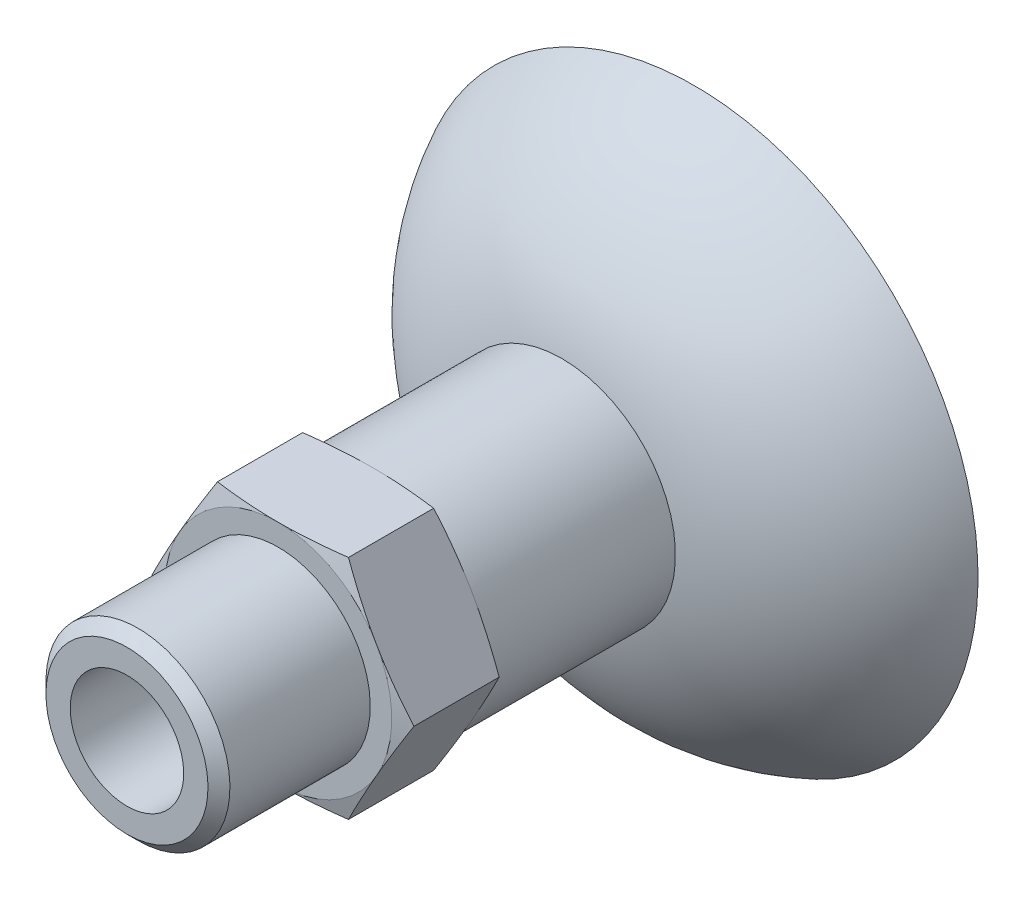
ISO-10303-21;
HEADER;
FILE_DESCRIPTION(('STEP AP214'),'2;1');
FILE_NAME('part.step','',(''),(''),'','','');
FILE_SCHEMA(('AUTOMOTIVE_DESIGN { 1 0 10303 214 1 1 1 1 }'));
ENDSEC;
DATA;
#1=APPLICATION_CONTEXT('core data for automotive mechanical design processes');
#2=APPLICATION_PROTOCOL_DEFINITION('international standard','automotive_design',2000,#1);
#3=PRODUCT_CONTEXT('',#1,'mechanical');
#4=PRODUCT('Part','Part','',(#3));
#5=PRODUCT_RELATED_PRODUCT_CATEGORY('part','',(#4));
#6=PRODUCT_DEFINITION_FORMATION('','',#4);
#7=PRODUCT_DEFINITION_CONTEXT('part definition',#1,'design');
#8=PRODUCT_DEFINITION('design','',#6,#7);
#9=PRODUCT_DEFINITION_SHAPE('','',#8);
#10=(LENGTH_UNIT() NAMED_UNIT(*) SI_UNIT(.MILLI.,.METRE.));
#11=(NAMED_UNIT(*) PLANE_ANGLE_UNIT() SI_UNIT($,.RADIAN.));
#12=(NAMED_UNIT(*) SI_UNIT($,.STERADIAN.) SOLID_ANGLE_UNIT());
#13=UNCERTAINTY_MEASURE_WITH_UNIT(LENGTH_MEASURE(1.E-05),#10,'distance_accuracy_value','');
#14=(GEOMETRIC_REPRESENTATION_CONTEXT(3) GLOBAL_UNCERTAINTY_ASSIGNED_CONTEXT((#13)) GLOBAL_UNIT_ASSIGNED_CONTEXT((#10,
#11,#12)) REPRESENTATION_CONTEXT('',''));
#15=CARTESIAN_POINT('',(0.,0.,0.));
#16=DIRECTION('',(0.,0.,1.));
#17=DIRECTION('',(1.,0.,0.));
#18=AXIS2_PLACEMENT_3D('',#15,#16,#17);
#19=CARTESIAN_POINT('',(6.92820323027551,0.,17.));
#20=DIRECTION('',(0.866025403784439,0.5,0.));
#21=DIRECTION('',(0.,0.,1.));
#22=AXIS2_PLACEMENT_3D('',#19,#20,#21);
#23=PLANE('',#22);
#24=DIRECTION('',(0.,0.,1.));
#25=VECTOR('',#24,1.);
#26=CARTESIAN_POINT('',(3.46410161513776,6.,17.));
#27=LINE('',#26,#25);
#28=CARTESIAN_POINT('',(3.46410161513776,6.,17.2487113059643));
#29=VERTEX_POINT('',#28);
#30=CARTESIAN_POINT('',(3.46410161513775,6.,21.7512886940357));
#31=VERTEX_POINT('',#30);
#32=EDGE_CURVE('E10',#29,#31,#27,.T.);
#33=ORIENTED_EDGE('',*,*,#32,.T.);
#34=CARTESIAN_POINT('',(5.19615242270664,3.00000000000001,22.));
#35=CARTESIAN_POINT('',(5.12404359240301,3.12480967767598,22.0000199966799));
#36=CARTESIAN_POINT('',(5.05188034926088,3.24958799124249,21.9986484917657));
#37=CARTESIAN_POINT('',(4.9079827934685,3.49847134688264,21.9931540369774));
#38=CARTESIAN_POINT('',(4.83624819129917,3.62257653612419,21.9890453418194));
#39=CARTESIAN_POINT('',(4.69263452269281,3.87142043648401,21.9780801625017));
#40=CARTESIAN_POINT('',(4.62075656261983,3.99615917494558,21.9712098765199));
#41=CARTESIAN_POINT('',(4.47601669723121,4.24735284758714,21.9547641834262));
#42=CARTESIAN_POINT('',(4.40315594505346,4.37380590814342,21.9451503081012));
#43=CARTESIAN_POINT('',(4.2592900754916,4.62306506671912,21.9237525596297));
#44=CARTESIAN_POINT('',(4.18828746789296,4.74587821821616,21.912033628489));
#45=CARTESIAN_POINT('',(4.04576334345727,4.99249350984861,21.8862377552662));
#46=CARTESIAN_POINT('',(3.97424314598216,5.11629421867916,21.8721398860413));
#47=CARTESIAN_POINT('',(3.83027325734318,5.36560571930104,21.8416075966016));
#48=CARTESIAN_POINT('',(3.75782595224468,5.49111391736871,21.8251409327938));
#49=CARTESIAN_POINT('',(3.61160134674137,5.74445673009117,21.7898805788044));
#50=CARTESIAN_POINT('',(3.53782665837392,5.87228726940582,21.7710466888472));
#51=CARTESIAN_POINT('',(3.46410161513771,5.99999999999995,21.7512886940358));
#52=B_SPLINE_CURVE_WITH_KNOTS('',3,(#34,#35,#36,#37,#38,#39,#40,#41,#42,#43,#44,#45,#46,#47,#48,
#49,#50,#51),.UNSPECIFIED.,.F.,.F.,(4,2,2,2,2,2,2,2,4),(0.,0.432421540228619,0.862608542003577,
1.29497279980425,1.73372521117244,2.16073850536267,2.59172526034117,3.02925966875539,
3.47560935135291),.UNSPECIFIED.);
#53=CARTESIAN_POINT('',(5.19615242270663,3.,22.));
#54=VERTEX_POINT('',#53);
#55=EDGE_CURVE('E683',#54,#31,#52,.T.);
#56=ORIENTED_EDGE('',*,*,#55,.F.);
#57=CARTESIAN_POINT('',(6.92820323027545,0.,21.7512886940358));
#58=CARTESIAN_POINT('',(6.85446990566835,0.127692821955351,21.7710449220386));
#59=CARTESIAN_POINT('',(6.78066033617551,0.255488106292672,21.7898769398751));
#60=CARTESIAN_POINT('',(6.634382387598,0.508780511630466,21.8251348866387));
#61=CARTESIAN_POINT('',(6.56191621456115,0.634273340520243,21.8416008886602));
#62=CARTESIAN_POINT('',(6.41799291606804,0.883612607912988,21.872133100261));
#63=CARTESIAN_POINT('',(6.34653685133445,1.00745570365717,21.8862314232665));
#64=CARTESIAN_POINT('',(6.20421306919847,1.2542062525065,21.9120298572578));
#65=CARTESIAN_POINT('',(6.13334596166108,1.37711187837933,21.9237507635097));
#66=CARTESIAN_POINT('',(5.98940836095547,1.62632912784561,21.9451502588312));
#67=CARTESIAN_POINT('',(5.916330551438,1.75264209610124,21.9547643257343));
#68=CARTESIAN_POINT('',(5.77116669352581,2.00357128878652,21.9712102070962));
#69=CARTESIAN_POINT('',(5.69908163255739,2.1281855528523,21.9780803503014));
#70=CARTESIAN_POINT('',(5.55538561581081,2.37698191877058,21.9890454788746));
#71=CARTESIAN_POINT('',(5.48377408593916,2.50116308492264,21.9931541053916));
#72=CARTESIAN_POINT('',(5.34017760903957,2.7502399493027,21.9986485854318));
#73=CARTESIAN_POINT('',(5.26819267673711,2.87513597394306,22.0000200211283));
#74=CARTESIAN_POINT('',(5.19615242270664,3.00000000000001,22.));
#75=B_SPLINE_CURVE_WITH_KNOTS('',3,(#57,#58,#59,#60,#61,#62,#63,#64,#65,#66,#67,#68,#69,#70,#71,
#72,#73,#74),.UNSPECIFIED.,.F.,.F.,(4,2,2,2,2,2,2,2,4),(0.,0.446310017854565,0.883832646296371,
1.3148334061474,1.7418840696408,2.18059822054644,2.61294971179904,3.04314949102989,
3.47560937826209),.UNSPECIFIED.);
#76=CARTESIAN_POINT('',(6.92820323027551,0.,21.7512886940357));
#77=VERTEX_POINT('',#76);
#78=EDGE_CURVE('E757',#77,#54,#75,.T.);
#79=ORIENTED_EDGE('',*,*,#78,.F.);
#80=DIRECTION('',(0.,0.,1.));
#81=VECTOR('',#80,1.);
#82=CARTESIAN_POINT('',(6.92820323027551,0.,17.));
#83=LINE('',#82,#81);
#84=CARTESIAN_POINT('',(6.92820323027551,0.,17.2487113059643));
#85=VERTEX_POINT('',#84);
#86=EDGE_CURVE('E497',#85,#77,#83,.T.);
#87=ORIENTED_EDGE('',*,*,#86,.F.);
#88=CARTESIAN_POINT('',(5.19615242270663,3.,17.));
#89=CARTESIAN_POINT('',(5.26818635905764,2.87514708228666,16.9999800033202));
#90=CARTESIAN_POINT('',(5.34016592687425,2.75026272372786,17.0013515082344));
#91=CARTESIAN_POINT('',(5.48375645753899,2.50120210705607,17.0068459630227));
#92=CARTESIAN_POINT('',(5.55536740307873,2.37702552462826,17.0109546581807));
#93=CARTESIAN_POINT('',(5.69906570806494,2.12823048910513,17.0219198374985));
#94=CARTESIAN_POINT('',(5.77115364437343,2.00361298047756,17.0287901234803));
#95=CARTESIAN_POINT('',(5.91632381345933,1.75266774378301,17.0452358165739));
#96=CARTESIAN_POINT('',(5.98940500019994,1.6263419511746,17.0548496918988));
#97=CARTESIAN_POINT('',(6.13333682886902,1.377120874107,17.0762474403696));
#98=CARTESIAN_POINT('',(6.20419483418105,1.25422423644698,17.0879663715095));
#99=CARTESIAN_POINT('',(6.34650787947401,1.00748707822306,17.1137622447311));
#100=CARTESIAN_POINT('',(6.41796233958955,0.883648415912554,17.1278601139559));
#101=CARTESIAN_POINT('',(6.56188748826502,0.634311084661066,17.1583924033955));
#102=CARTESIAN_POINT('',(6.63435712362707,0.50881577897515,17.1748590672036));
#103=CARTESIAN_POINT('',(6.78064613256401,0.25551014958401,17.210119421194));
#104=CARTESIAN_POINT('',(6.8544632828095,0.127704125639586,17.2289533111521));
#105=CARTESIAN_POINT('',(6.92820323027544,0.,17.2487113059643));
#106=B_SPLINE_CURVE_WITH_KNOTS('',3,(#88,#89,#90,#91,#92,#93,#94,#95,#96,#97,#98,#99,#100,#101,
#102,#103,#104,#105),.UNSPECIFIED.,.F.,.F.,(4,2,2,2,2,2,2,2,4),(0.,0.432421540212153,
0.862608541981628,1.29497279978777,1.73372521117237,2.16073850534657,2.59172526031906,
3.02925966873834,3.4756093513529),.UNSPECIFIED.);
#107=CARTESIAN_POINT('',(5.19615242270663,3.,17.));
#108=VERTEX_POINT('',#107);
#109=EDGE_CURVE('E491',#108,#85,#106,.T.);
#110=ORIENTED_EDGE('',*,*,#109,.F.);
#111=CARTESIAN_POINT('',(3.46410161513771,5.99999999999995,17.2487113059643));
#112=CARTESIAN_POINT('',(3.53782018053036,5.87229865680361,17.2289550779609));
#113=CARTESIAN_POINT('',(3.61158935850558,5.74448005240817,17.2101230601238));
#114=CARTESIAN_POINT('',(3.7578080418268,5.49115343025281,17.1748651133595));
#115=CARTESIAN_POINT('',(3.83025493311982,5.3656494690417,17.1583991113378));
#116=CARTESIAN_POINT('',(3.9742274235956,5.11633860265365,17.127866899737));
#117=CARTESIAN_POINT('',(4.04575065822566,4.99253428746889,17.1137685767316));
#118=CARTESIAN_POINT('',(4.18828101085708,4.74590300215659,17.0879701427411));
#119=CARTESIAN_POINT('',(4.25928685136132,4.62307747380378,17.0762492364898));
#120=CARTESIAN_POINT('',(4.40314652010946,4.37381523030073,17.0548497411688));
#121=CARTESIAN_POINT('',(4.47599785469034,4.24737150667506,17.0452356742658));
#122=CARTESIAN_POINT('',(4.62072698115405,3.99619132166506,17.028789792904));
#123=CARTESIAN_POINT('',(4.69260356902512,3.87145669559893,17.0219196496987));
#124=CARTESIAN_POINT('',(4.83621953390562,3.62261411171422,17.0109545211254));
#125=CARTESIAN_POINT('',(4.90795781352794,3.49850612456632,17.0068458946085));
#126=CARTESIAN_POINT('',(5.05186646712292,3.24960949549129,17.0013514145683));
#127=CARTESIAN_POINT('',(5.12403713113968,3.12482070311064,16.9999799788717));
#128=CARTESIAN_POINT('',(5.19615242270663,3.,17.));
#129=B_SPLINE_CURVE_WITH_KNOTS('',3,(#111,#112,#113,#114,#115,#116,#117,#118,#119,#120,#121,
#122,#123,#124,#125,#126,#127,#128),.UNSPECIFIED.,.F.,.F.,(4,2,2,2,2,2,2,2,4),(0.,
0.446310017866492,0.883832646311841,1.31483340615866,1.74188406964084,2.18059822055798,
2.61294971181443,3.04314949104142,3.47560937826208),.UNSPECIFIED.);
#130=EDGE_CURVE('E473',#29,#108,#129,.T.);
#131=ORIENTED_EDGE('',*,*,#130,.F.);
#132=EDGE_LOOP('',(#33,#56,#79,#87,#110,#131));
#133=FACE_BOUND('',#132,.T.);
#134=ADVANCED_FACE('F15',(#133),#23,.T.);
#135=CARTESIAN_POINT('',(3.46410161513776,6.,17.));
#136=DIRECTION('',(0.,1.,0.));
#137=DIRECTION('',(-1.,0.,0.));
#138=AXIS2_PLACEMENT_3D('',#135,#136,#137);
#139=PLANE('',#138);
#140=DIRECTION('',(0.,0.,1.));
#141=VECTOR('',#140,1.);
#142=CARTESIAN_POINT('',(-3.46410161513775,6.,17.));
#143=LINE('',#142,#141);
#144=CARTESIAN_POINT('',(-3.46410161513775,6.,17.2487113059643));
#145=VERTEX_POINT('',#144);
#146=CARTESIAN_POINT('',(-3.46410161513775,6.,21.7512886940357));
#147=VERTEX_POINT('',#146);
#148=EDGE_CURVE('E29',#145,#147,#143,.T.);
#149=ORIENTED_EDGE('',*,*,#148,.T.);
#150=CARTESIAN_POINT('',(0.,6.00000000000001,22.));
#151=CARTESIAN_POINT('',(-0.144124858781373,5.99995669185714,22.0000200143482));
#152=CARTESIAN_POINT('',(-0.288249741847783,5.99985529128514,21.998647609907));
#153=CARTESIAN_POINT('',(-0.575724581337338,5.9996917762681,21.9931504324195));
#154=CARTESIAN_POINT('',(-0.719074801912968,5.99962946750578,21.9890394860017));
#155=CARTESIAN_POINT('',(-1.00641973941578,5.99969625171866,21.9780688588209));
#156=CARTESIAN_POINT('',(-1.15041390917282,5.99982634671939,21.9711949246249));
#157=CARTESIAN_POINT('',(-1.44040510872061,6.00008659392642,21.9547411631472));
#158=CARTESIAN_POINT('',(-1.58639991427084,6.00021671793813,21.9451224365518));
#159=CARTESIAN_POINT('',(-1.87425873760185,6.00025188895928,21.9237187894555));
#160=CARTESIAN_POINT('',(-2.0161276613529,6.00016292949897,21.9119995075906));
#161=CARTESIAN_POINT('',(-2.30096544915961,6.00002759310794,21.8862047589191));
#162=CARTESIAN_POINT('',(-2.44393243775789,5.99998161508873,21.872108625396));
#163=CARTESIAN_POINT('',(-2.73179478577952,5.99993999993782,21.8415817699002));
#164=CARTESIAN_POINT('',(-2.87668673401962,5.99994513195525,21.8251190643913));
#165=CARTESIAN_POINT('',(-3.16913182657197,5.99997062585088,21.7898686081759));
#166=CARTESIAN_POINT('',(-3.3166801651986,5.9999912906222,21.771040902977));
#167=CARTESIAN_POINT('',(-3.46410161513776,6.00000000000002,21.7512886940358));
#168=B_SPLINE_CURVE_WITH_KNOTS('',3,(#150,#151,#152,#153,#154,#155,#156,#157,#158,#159,#160,
#161,#162,#163,#164,#165,#166,#167),.UNSPECIFIED.,.F.,.F.,(4,2,2,2,2,2,2,2,4),(0.,
0.432367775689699,0.86256894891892,1.2950184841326,1.73393012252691,2.16096837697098,
2.59193173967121,3.02939030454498,3.47560819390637),.UNSPECIFIED.);
#169=CARTESIAN_POINT('',(0.,6.,22.));
#170=VERTEX_POINT('',#169);
#171=EDGE_CURVE('E690',#170,#147,#168,.T.);
#172=ORIENTED_EDGE('',*,*,#171,.F.);
#173=CARTESIAN_POINT('',(3.46410161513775,6.00000000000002,21.7512886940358));
#174=CARTESIAN_POINT('',(3.31726869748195,5.99999159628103,21.7709619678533));
#175=CARTESIAN_POINT('',(3.17031004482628,5.99996749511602,21.7897190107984));
#176=CARTESIAN_POINT('',(2.87903739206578,5.99993021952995,21.8248474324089));
#177=CARTESIAN_POINT('',(2.73472816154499,5.9999168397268,21.8412584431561));
#178=CARTESIAN_POINT('',(2.4480336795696,5.99993958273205,21.8717010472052));
#179=CARTESIAN_POINT('',(2.30565182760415,5.99997497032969,21.8857644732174));
#180=CARTESIAN_POINT('',(2.02199764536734,6.00008886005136,21.9115131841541));
#181=CARTESIAN_POINT('',(1.88072720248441,6.00016696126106,21.9232192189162));
#182=CARTESIAN_POINT('',(1.59291852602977,6.00012156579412,21.9447025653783));
#183=CARTESIAN_POINT('',(1.44637393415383,5.99999070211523,21.9543951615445));
#184=CARTESIAN_POINT('',(1.15526705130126,5.99974077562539,21.9709752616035));
#185=CARTESIAN_POINT('',(1.01070698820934,5.99962156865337,21.9779015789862));
#186=CARTESIAN_POINT('',(0.72219940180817,5.99958067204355,21.9889562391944));
#187=CARTESIAN_POINT('',(0.578252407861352,5.99965800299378,21.9930983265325));
#188=CARTESIAN_POINT('',(0.289537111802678,5.99984558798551,21.9986377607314));
#189=CARTESIAN_POINT('',(0.14476852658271,5.9999560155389,22.0000203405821));
#190=CARTESIAN_POINT('',(0.,6.00000000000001,22.));
#191=B_SPLINE_CURVE_WITH_KNOTS('',3,(#173,#174,#175,#176,#177,#178,#179,#180,#181,#182,#183,
#184,#185,#186,#187,#188,#189,#190),.UNSPECIFIED.,.F.,.F.,(4,2,2,2,2,2,2,2,4),(0.,
0.444436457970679,0.880140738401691,1.30934776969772,1.73459368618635,2.17516540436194,
2.60931783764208,3.04131099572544,3.47560975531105),.UNSPECIFIED.);
#192=EDGE_CURVE('E679',#31,#170,#191,.T.);
#193=ORIENTED_EDGE('',*,*,#192,.F.);
#194=ORIENTED_EDGE('',*,*,#32,.F.);
#195=CARTESIAN_POINT('',(0.,6.,17.));
#196=CARTESIAN_POINT('',(0.144124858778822,5.99995669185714,16.9999799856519));
#197=CARTESIAN_POINT('',(0.288249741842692,5.99985529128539,17.001352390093));
#198=CARTESIAN_POINT('',(0.575724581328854,5.99969177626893,17.0068495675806));
#199=CARTESIAN_POINT('',(0.719074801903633,5.99962946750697,17.0109605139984));
#200=CARTESIAN_POINT('',(1.00641973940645,5.99969625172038,17.0219311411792));
#201=CARTESIAN_POINT('',(1.15041390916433,5.99982634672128,17.0288050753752));
#202=CARTESIAN_POINT('',(1.44040510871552,6.0000865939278,17.0452588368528));
#203=CARTESIAN_POINT('',(1.58639991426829,6.00021671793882,17.0548775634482));
#204=CARTESIAN_POINT('',(1.87425873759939,6.00025188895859,17.0762812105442));
#205=CARTESIAN_POINT('',(2.01612766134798,6.0001629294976,17.0880004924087));
#206=CARTESIAN_POINT('',(2.30096544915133,6.00002759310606,17.1137952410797));
#207=CARTESIAN_POINT('',(2.44393243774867,5.99998161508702,17.1278913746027));
#208=CARTESIAN_POINT('',(2.73179478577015,5.99993999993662,17.1584182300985));
#209=CARTESIAN_POINT('',(2.87668673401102,5.9999451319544,17.1748809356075));
#210=CARTESIAN_POINT('',(3.16913182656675,5.99997062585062,17.2101313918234));
#211=CARTESIAN_POINT('',(3.31668016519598,5.99999129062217,17.2289590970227));
#212=CARTESIAN_POINT('',(3.46410161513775,6.00000000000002,17.2487113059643));
#213=B_SPLINE_CURVE_WITH_KNOTS('',3,(#195,#196,#197,#198,#199,#200,#201,#202,#203,#204,#205,
#206,#207,#208,#209,#210,#211,#212),.UNSPECIFIED.,.F.,.F.,(4,2,2,2,2,2,2,2,4),(0.,
0.432367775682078,0.862568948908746,1.29501848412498,1.7339301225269,2.16096837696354,
2.59193173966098,3.02939030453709,3.47560819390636),.UNSPECIFIED.);
#214=CARTESIAN_POINT('',(0.,6.,17.));
#215=VERTEX_POINT('',#214);
#216=EDGE_CURVE('E436',#215,#29,#213,.T.);
#217=ORIENTED_EDGE('',*,*,#216,.F.);
#218=CARTESIAN_POINT('',(-3.46410161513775,6.00000000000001,17.2487113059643));
#219=CARTESIAN_POINT('',(-3.31726869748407,5.99999159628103,17.229038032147));
#220=CARTESIAN_POINT('',(-3.17031004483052,5.99996749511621,17.2102809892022));
#221=CARTESIAN_POINT('',(-2.87903739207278,5.99993021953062,17.1751525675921));
#222=CARTESIAN_POINT('',(-2.73472816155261,5.99991683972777,17.158741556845));
#223=CARTESIAN_POINT('',(-2.44803367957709,5.99993958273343,17.1282989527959));
#224=CARTESIAN_POINT('',(-2.30565182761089,5.99997497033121,17.1142355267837));
#225=CARTESIAN_POINT('',(-2.02199764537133,6.00008886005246,17.0884868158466));
#226=CARTESIAN_POINT('',(-1.8807272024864,6.00016696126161,17.0767807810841));
#227=CARTESIAN_POINT('',(-1.59291852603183,6.00012156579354,17.0552974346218));
#228=CARTESIAN_POINT('',(-1.44637393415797,5.99999070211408,17.0456048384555));
#229=CARTESIAN_POINT('',(-1.15526705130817,5.99974077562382,17.0290247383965));
#230=CARTESIAN_POINT('',(-1.01070698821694,5.99962156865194,17.0220984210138));
#231=CARTESIAN_POINT('',(-0.722199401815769,5.99958067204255,17.0110437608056));
#232=CARTESIAN_POINT('',(-0.578252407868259,5.99965800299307,17.0069016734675));
#233=CARTESIAN_POINT('',(-0.289537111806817,5.99984558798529,17.0013622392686));
#234=CARTESIAN_POINT('',(-0.144768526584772,5.99995601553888,16.9999796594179));
#235=CARTESIAN_POINT('',(0.,6.,17.));
#236=B_SPLINE_CURVE_WITH_KNOTS('',3,(#218,#219,#220,#221,#222,#223,#224,#225,#226,#227,#228,
#229,#230,#231,#232,#233,#234,#235),.UNSPECIFIED.,.F.,.F.,(4,2,2,2,2,2,2,2,4),(0.,
0.444436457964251,0.880140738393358,1.30934776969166,1.73459368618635,2.17516540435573,
2.6093178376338,3.04131099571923,3.47560975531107),.UNSPECIFIED.);
#237=EDGE_CURVE('E437',#145,#215,#236,.T.);
#238=ORIENTED_EDGE('',*,*,#237,.F.);
#239=EDGE_LOOP('',(#149,#172,#193,#194,#217,#238));
#240=FACE_BOUND('',#239,.T.);
#241=ADVANCED_FACE('F213',(#240),#139,.T.);
#242=CARTESIAN_POINT('',(-3.46410161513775,6.,17.));
#243=DIRECTION('',(-0.866025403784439,0.5,0.));
#244=DIRECTION('',(0.,0.,-1.));
#245=AXIS2_PLACEMENT_3D('',#242,#243,#244);
#246=PLANE('',#245);
#247=DIRECTION('',(0.,0.,1.));
#248=VECTOR('',#247,1.);
#249=CARTESIAN_POINT('',(-6.92820323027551,0.,17.));
#250=LINE('',#249,#248);
#251=CARTESIAN_POINT('',(-6.92820323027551,0.,17.2487113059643));
#252=VERTEX_POINT('',#251);
#253=CARTESIAN_POINT('',(-6.92820323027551,0.,21.7512886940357));
#254=VERTEX_POINT('',#253);
#255=EDGE_CURVE('E107',#252,#254,#250,.T.);
#256=ORIENTED_EDGE('',*,*,#255,.T.);
#257=CARTESIAN_POINT('',(-5.19615242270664,3.,22.));
#258=CARTESIAN_POINT('',(-5.26818635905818,2.87514708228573,22.0000199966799));
#259=CARTESIAN_POINT('',(-5.34016592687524,2.75026272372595,21.9986484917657));
#260=CARTESIAN_POINT('',(-5.48375645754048,2.5012021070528,21.9931540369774));
#261=CARTESIAN_POINT('',(-5.55536740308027,2.3770255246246,21.9890453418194));
#262=CARTESIAN_POINT('',(-5.69906570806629,2.12823048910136,21.9780801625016));
#263=CARTESIAN_POINT('',(-5.77115364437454,2.00361298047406,21.9712098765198));
#264=CARTESIAN_POINT('',(-5.91632381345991,1.75266774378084,21.9547641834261));
#265=CARTESIAN_POINT('',(-5.98940500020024,1.6263419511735,21.9451503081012));
#266=CARTESIAN_POINT('',(-6.1333368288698,1.37712087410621,21.9237525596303));
#267=CARTESIAN_POINT('',(-6.20419483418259,1.25422423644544,21.9120336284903));
#268=CARTESIAN_POINT('',(-6.34650787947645,1.00748707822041,21.8862377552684));
#269=CARTESIAN_POINT('',(-6.41796233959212,0.883648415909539,21.8721398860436));
#270=CARTESIAN_POINT('',(-6.56188748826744,0.634311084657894,21.841607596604));
#271=CARTESIAN_POINT('',(-6.6343571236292,0.508815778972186,21.8251409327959));
#272=CARTESIAN_POINT('',(-6.78064613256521,0.255510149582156,21.7898805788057));
#273=CARTESIAN_POINT('',(-6.85446328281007,0.127704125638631,21.7710466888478));
#274=CARTESIAN_POINT('',(-6.92820323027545,0.,21.7512886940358));
#275=B_SPLINE_CURVE_WITH_KNOTS('',3,(#257,#258,#259,#260,#261,#262,#263,#264,#265,#266,#267,
#268,#269,#270,#271,#272,#273,#274),.UNSPECIFIED.,.F.,.F.,(4,2,2,2,2,2,2,2,4),(0.,
0.432421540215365,0.862608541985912,1.29497279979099,1.73372521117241,2.16073850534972,
2.59172526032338,3.02925966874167,3.4756093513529),.UNSPECIFIED.);
#276=CARTESIAN_POINT('',(-5.19615242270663,3.,22.));
#277=VERTEX_POINT('',#276);
#278=EDGE_CURVE('E861',#277,#254,#275,.T.);
#279=ORIENTED_EDGE('',*,*,#278,.F.);
#280=CARTESIAN_POINT('',(-3.46410161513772,5.99999999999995,21.7512886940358));
#281=CARTESIAN_POINT('',(-3.53782018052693,5.87229865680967,21.7710449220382));
#282=CARTESIAN_POINT('',(-3.61158935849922,5.74448005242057,21.7898769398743));
#283=CARTESIAN_POINT('',(-3.75780804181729,5.49115343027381,21.8251348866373));
#284=CARTESIAN_POINT('',(-3.83025493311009,5.36564946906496,21.8416008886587));
#285=CARTESIAN_POINT('',(-3.97422742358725,5.11633860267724,21.8721331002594));
#286=CARTESIAN_POINT('',(-4.04575065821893,4.99253428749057,21.8862314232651));
#287=CARTESIAN_POINT('',(-4.18828101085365,4.74590300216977,21.912029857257));
#288=CARTESIAN_POINT('',(-4.2592868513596,4.62307747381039,21.9237507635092));
#289=CARTESIAN_POINT('',(-4.40314652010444,4.3738152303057,21.9451502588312));
#290=CARTESIAN_POINT('',(-4.47599785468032,4.247371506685,21.9547643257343));
#291=CARTESIAN_POINT('',(-4.62072698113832,3.99619132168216,21.9712102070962));
#292=CARTESIAN_POINT('',(-4.69260356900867,3.87145669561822,21.9780803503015));
#293=CARTESIAN_POINT('',(-4.83621953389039,3.62261411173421,21.9890454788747));
#294=CARTESIAN_POINT('',(-4.90795781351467,3.49850612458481,21.9931541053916));
#295=CARTESIAN_POINT('',(-5.05186646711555,3.24960949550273,21.9986485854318));
#296=CARTESIAN_POINT('',(-5.12403713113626,3.1248207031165,22.0000200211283));
#297=CARTESIAN_POINT('',(-5.19615242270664,3.,22.));
#298=B_SPLINE_CURVE_WITH_KNOTS('',3,(#280,#281,#282,#283,#284,#285,#286,#287,#288,#289,#290,
#291,#292,#293,#294,#295,#296,#297),.UNSPECIFIED.,.F.,.F.,(4,2,2,2,2,2,2,2,4),(0.,
0.446310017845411,0.883832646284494,1.31483340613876,1.74188406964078,2.18059822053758,
2.61294971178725,3.04314949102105,3.47560937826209),.UNSPECIFIED.);
#299=EDGE_CURVE('E692',#147,#277,#298,.T.);
#300=ORIENTED_EDGE('',*,*,#299,.F.);
#301=ORIENTED_EDGE('',*,*,#148,.F.);
#302=CARTESIAN_POINT('',(-5.19615242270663,3.,17.));
#303=CARTESIAN_POINT('',(-5.12404359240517,3.12480967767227,16.9999800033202));
#304=CARTESIAN_POINT('',(-5.05188034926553,3.24958799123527,17.0013515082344));
#305=CARTESIAN_POINT('',(-4.90798279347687,3.49847134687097,17.0068459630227));
#306=CARTESIAN_POINT('',(-4.83624819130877,3.62257653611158,17.0109546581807));
#307=CARTESIAN_POINT('',(-4.69263452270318,3.87142043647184,17.0219198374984));
#308=CARTESIAN_POINT('',(-4.62075656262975,3.99615917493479,17.0287901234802));
#309=CARTESIAN_POINT('',(-4.47601669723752,4.24735284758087,17.0452358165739));
#310=CARTESIAN_POINT('',(-4.40315594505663,4.37380590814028,17.0548496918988));
#311=CARTESIAN_POINT('',(-4.25929007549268,4.62306506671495,17.0762474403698));
#312=CARTESIAN_POINT('',(-4.18828746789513,4.74587821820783,17.0879663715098));
#313=CARTESIAN_POINT('',(-4.04576334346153,4.99249350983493,17.1137622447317));
#314=CARTESIAN_POINT('',(-3.97424314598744,5.11629421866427,17.1278601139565));
#315=CARTESIAN_POINT('',(-3.83027325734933,5.36560571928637,17.1583924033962));
#316=CARTESIAN_POINT('',(-3.7578259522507,5.49111391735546,17.1748590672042));
#317=CARTESIAN_POINT('',(-3.6116013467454,5.74445673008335,17.2101194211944));
#318=CARTESIAN_POINT('',(-3.53782665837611,5.872287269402,17.2289533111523));
#319=CARTESIAN_POINT('',(-3.46410161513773,5.99999999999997,17.2487113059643));
#320=B_SPLINE_CURVE_WITH_KNOTS('',3,(#302,#303,#304,#305,#306,#307,#308,#309,#310,#311,#312,
#313,#314,#315,#316,#317,#318,#319),.UNSPECIFIED.,.F.,.F.,(4,2,2,2,2,2,2,2,4),(0.,
0.432421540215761,0.862608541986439,1.29497279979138,1.7337252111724,2.16073850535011,
2.59172526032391,3.02925966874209,3.47560935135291),.UNSPECIFIED.);
#321=CARTESIAN_POINT('',(-5.19615242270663,3.,17.));
#322=VERTEX_POINT('',#321);
#323=EDGE_CURVE('E593',#322,#145,#320,.T.);
#324=ORIENTED_EDGE('',*,*,#323,.F.);
#325=CARTESIAN_POINT('',(-6.92820323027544,0.,17.2487113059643));
#326=CARTESIAN_POINT('',(-6.85446990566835,0.127692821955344,17.2289550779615));
#327=CARTESIAN_POINT('',(-6.78066033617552,0.255488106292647,17.2101230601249));
#328=CARTESIAN_POINT('',(-6.63438238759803,0.508780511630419,17.1748651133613));
#329=CARTESIAN_POINT('',(-6.56191621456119,0.63427334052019,17.1583991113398));
#330=CARTESIAN_POINT('',(-6.41799291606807,0.883612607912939,17.127866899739));
#331=CARTESIAN_POINT('',(-6.34653685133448,1.00745570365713,17.1137685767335));
#332=CARTESIAN_POINT('',(-6.20421306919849,1.25420625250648,17.0879701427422));
#333=CARTESIAN_POINT('',(-6.13334596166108,1.37711187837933,17.0762492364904));
#334=CARTESIAN_POINT('',(-5.98940836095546,1.6263291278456,17.0548497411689));
#335=CARTESIAN_POINT('',(-5.916330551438,1.7526420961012,17.0452356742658));
#336=CARTESIAN_POINT('',(-5.77116669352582,2.00357128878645,17.0287897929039));
#337=CARTESIAN_POINT('',(-5.69908163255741,2.12818555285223,17.0219196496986));
#338=CARTESIAN_POINT('',(-5.55538561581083,2.37698191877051,17.0109545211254));
#339=CARTESIAN_POINT('',(-5.48377408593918,2.50116308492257,17.0068458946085));
#340=CARTESIAN_POINT('',(-5.34017760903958,2.75023994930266,17.0013514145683));
#341=CARTESIAN_POINT('',(-5.26819267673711,2.87513597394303,16.9999799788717));
#342=CARTESIAN_POINT('',(-5.19615242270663,3.,17.));
#343=B_SPLINE_CURVE_WITH_KNOTS('',3,(#325,#326,#327,#328,#329,#330,#331,#332,#333,#334,#335,
#336,#337,#338,#339,#340,#341,#342),.UNSPECIFIED.,.F.,.F.,(4,2,2,2,2,2,2,2,4),(0.,
0.4463100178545,0.883832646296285,1.31483340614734,1.7418840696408,2.18059822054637,
2.61294971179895,3.04314949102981,3.47560937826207),.UNSPECIFIED.);
#344=EDGE_CURVE('E326',#252,#322,#343,.T.);
#345=ORIENTED_EDGE('',*,*,#344,.F.);
#346=EDGE_LOOP('',(#256,#279,#300,#301,#324,#345));
#347=FACE_BOUND('',#346,.T.);
#348=ADVANCED_FACE('F284',(#347),#246,.T.);
#349=CARTESIAN_POINT('',(-6.92820323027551,0.,17.));
#350=DIRECTION('',(-0.866025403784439,-0.5,0.));
#351=DIRECTION('',(0.,0.,-1.));
#352=AXIS2_PLACEMENT_3D('',#349,#350,#351);
#353=PLANE('',#352);
#354=DIRECTION('',(0.,0.,1.));
#355=VECTOR('',#354,1.);
#356=CARTESIAN_POINT('',(-3.46410161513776,-6.,17.));
#357=LINE('',#356,#355);
#358=CARTESIAN_POINT('',(-3.46410161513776,-6.,17.2487113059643));
#359=VERTEX_POINT('',#358);
#360=CARTESIAN_POINT('',(-3.46410161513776,-6.,21.7512886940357));
#361=VERTEX_POINT('',#360);
#362=EDGE_CURVE('E128',#359,#361,#357,.T.);
#363=ORIENTED_EDGE('',*,*,#362,.T.);
#364=CARTESIAN_POINT('',(-5.19615242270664,-3.,22.));
#365=CARTESIAN_POINT('',(-5.12404359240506,-3.12480967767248,22.0000199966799));
#366=CARTESIAN_POINT('',(-5.05188034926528,-3.24958799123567,21.9986484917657));
#367=CARTESIAN_POINT('',(-4.90798279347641,-3.49847134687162,21.9931540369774));
#368=CARTESIAN_POINT('',(-4.83624819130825,-3.62257653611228,21.9890453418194));
#369=CARTESIAN_POINT('',(-4.69263452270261,-3.87142043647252,21.9780801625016));
#370=CARTESIAN_POINT('',(-4.62075656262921,-3.99615917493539,21.9712098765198));
#371=CARTESIAN_POINT('',(-4.47601669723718,-4.24735284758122,21.9547641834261));
#372=CARTESIAN_POINT('',(-4.40315594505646,-4.37380590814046,21.9451503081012));
#373=CARTESIAN_POINT('',(-4.25929007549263,-4.62306506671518,21.9237525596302));
#374=CARTESIAN_POINT('',(-4.18828746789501,-4.7458782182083,21.9120336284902));
#375=CARTESIAN_POINT('',(-4.0457633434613,-4.99249350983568,21.8862377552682));
#376=CARTESIAN_POINT('',(-3.97424314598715,-5.1162942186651,21.8721398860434));
#377=CARTESIAN_POINT('',(-3.830273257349,-5.36560571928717,21.8416075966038));
#378=CARTESIAN_POINT('',(-3.75782595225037,-5.49111391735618,21.8251409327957));
#379=CARTESIAN_POINT('',(-3.61160134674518,-5.74445673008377,21.7898805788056));
#380=CARTESIAN_POINT('',(-3.53782665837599,-5.8722872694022,21.7710466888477));
#381=CARTESIAN_POINT('',(-3.46410161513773,-5.99999999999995,21.7512886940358));
#382=B_SPLINE_CURVE_WITH_KNOTS('',3,(#364,#365,#366,#367,#368,#369,#370,#371,#372,#373,#374,
#375,#376,#377,#378,#379,#380,#381),.UNSPECIFIED.,.F.,.F.,(4,2,2,2,2,2,2,2,4),(0.,
0.432421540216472,0.862608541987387,1.2949727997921,1.7337252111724,2.1607385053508,
2.59172526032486,3.02925966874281,3.47560935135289),.UNSPECIFIED.);
#383=CARTESIAN_POINT('',(-5.19615242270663,-3.,22.));
#384=VERTEX_POINT('',#383);
#385=EDGE_CURVE('E246',#384,#361,#382,.T.);
#386=ORIENTED_EDGE('',*,*,#385,.F.);
#387=CARTESIAN_POINT('',(-6.92820323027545,0.,21.7512886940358));
#388=CARTESIAN_POINT('',(-6.85446990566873,-0.127692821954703,21.7710449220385));
#389=CARTESIAN_POINT('',(-6.78066033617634,-0.255488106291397,21.7898769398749));
#390=CARTESIAN_POINT('',(-6.63438238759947,-0.508780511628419,21.8251348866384));
#391=CARTESIAN_POINT('',(-6.56191621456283,-0.634273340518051,21.8416008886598));
#392=CARTESIAN_POINT('',(-6.41799291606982,-0.883612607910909,21.8721331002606));
#393=CARTESIAN_POINT('',(-6.34653685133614,-1.00745570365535,21.8862314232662));
#394=CARTESIAN_POINT('',(-6.20421306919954,-1.25420625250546,21.9120298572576));
#395=CARTESIAN_POINT('',(-6.13334596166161,-1.37711187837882,21.9237507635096));
#396=CARTESIAN_POINT('',(-5.98940836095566,-1.62632912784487,21.9451502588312));
#397=CARTESIAN_POINT('',(-5.91633055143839,-1.75264209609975,21.9547643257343));
#398=CARTESIAN_POINT('',(-5.77116669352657,-2.00357128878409,21.9712102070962));
#399=CARTESIAN_POINT('',(-5.69908163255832,-2.12818555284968,21.9780803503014));
#400=CARTESIAN_POINT('',(-5.55538561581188,-2.37698191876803,21.9890454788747));
#401=CARTESIAN_POINT('',(-5.48377408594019,-2.50116308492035,21.9931541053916));
#402=CARTESIAN_POINT('',(-5.34017760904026,-2.75023994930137,21.9986485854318));
#403=CARTESIAN_POINT('',(-5.26819267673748,-2.8751359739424,22.0000200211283));
#404=CARTESIAN_POINT('',(-5.19615242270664,-3.,22.));
#405=B_SPLINE_CURVE_WITH_KNOTS('',3,(#387,#388,#389,#390,#391,#392,#393,#394,#395,#396,#397,
#398,#399,#400,#401,#402,#403,#404),.UNSPECIFIED.,.F.,.F.,(4,2,2,2,2,2,2,2,4),(0.,
0.446310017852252,0.88383264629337,1.31483340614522,1.7418840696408,2.1805982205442,
2.61294971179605,3.04314949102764,3.47560937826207),.UNSPECIFIED.);
#406=EDGE_CURVE('E859',#254,#384,#405,.T.);
#407=ORIENTED_EDGE('',*,*,#406,.F.);
#408=ORIENTED_EDGE('',*,*,#255,.F.);
#409=CARTESIAN_POINT('',(-5.19615242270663,-3.,17.));
#410=CARTESIAN_POINT('',(-5.268186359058,-2.87514708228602,16.9999800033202));
#411=CARTESIAN_POINT('',(-5.34016592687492,-2.75026272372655,17.0013515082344));
#412=CARTESIAN_POINT('',(-5.48375645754,-2.50120210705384,17.0068459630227));
#413=CARTESIAN_POINT('',(-5.55536740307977,-2.37702552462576,17.0109546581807));
#414=CARTESIAN_POINT('',(-5.69906570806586,-2.12823048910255,17.0219198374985));
#415=CARTESIAN_POINT('',(-5.77115364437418,-2.00361298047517,17.0287901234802));
#416=CARTESIAN_POINT('',(-5.91632381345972,-1.75266774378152,17.0452358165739));
#417=CARTESIAN_POINT('',(-5.98940500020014,-1.62634195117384,17.0548496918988));
#418=CARTESIAN_POINT('',(-6.13333682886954,-1.37712087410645,17.0762474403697));
#419=CARTESIAN_POINT('',(-6.2041948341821,-1.25422423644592,17.0879663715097));
#420=CARTESIAN_POINT('',(-6.34650787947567,-1.00748707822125,17.1137622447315));
#421=CARTESIAN_POINT('',(-6.4179623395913,-0.883648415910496,17.1278601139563));
#422=CARTESIAN_POINT('',(-6.56188748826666,-0.634311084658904,17.1583924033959));
#423=CARTESIAN_POINT('',(-6.63435712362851,-0.508815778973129,17.174859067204));
#424=CARTESIAN_POINT('',(-6.78064613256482,-0.255510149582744,17.2101194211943));
#425=CARTESIAN_POINT('',(-6.85446328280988,-0.127704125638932,17.2289533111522));
#426=CARTESIAN_POINT('',(-6.92820323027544,0.,17.2487113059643));
#427=B_SPLINE_CURVE_WITH_KNOTS('',3,(#409,#410,#411,#412,#413,#414,#415,#416,#417,#418,#419,
#420,#421,#422,#423,#424,#425,#426),.UNSPECIFIED.,.F.,.F.,(4,2,2,2,2,2,2,2,4),(0.,
0.43242154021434,0.862608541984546,1.29497279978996,1.7337252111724,2.16073850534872,
2.591725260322,3.0292596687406,3.4756093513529),.UNSPECIFIED.);
#428=CARTESIAN_POINT('',(-5.19615242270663,-3.,17.));
#429=VERTEX_POINT('',#428);
#430=EDGE_CURVE('E318',#429,#252,#427,.T.);
#431=ORIENTED_EDGE('',*,*,#430,.F.);
#432=CARTESIAN_POINT('',(-3.46410161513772,-5.99999999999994,17.2487113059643));
#433=CARTESIAN_POINT('',(-3.53782018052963,-5.8722986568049,17.2289550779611));
#434=CARTESIAN_POINT('',(-3.61158935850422,-5.74448005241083,17.2101230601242));
#435=CARTESIAN_POINT('',(-3.75780804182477,-5.49115343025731,17.1748651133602));
#436=CARTESIAN_POINT('',(-3.83025493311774,-5.36564946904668,17.1583991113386));
#437=CARTESIAN_POINT('',(-3.97422742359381,-5.11633860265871,17.1278668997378));
#438=CARTESIAN_POINT('',(-4.04575065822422,-4.99253428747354,17.1137685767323));
#439=CARTESIAN_POINT('',(-4.18828101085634,-4.74590300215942,17.0879701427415));
#440=CARTESIAN_POINT('',(-4.25928685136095,-4.62307747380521,17.07624923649));
#441=CARTESIAN_POINT('',(-4.40314652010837,-4.3738152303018,17.0548497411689));
#442=CARTESIAN_POINT('',(-4.47599785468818,-4.2473715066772,17.0452356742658));
#443=CARTESIAN_POINT('',(-4.62072698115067,-3.99619132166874,17.028789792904));
#444=CARTESIAN_POINT('',(-4.69260356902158,-3.87145669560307,17.0219196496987));
#445=CARTESIAN_POINT('',(-4.83621953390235,-3.62261411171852,17.0109545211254));
#446=CARTESIAN_POINT('',(-4.90795781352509,-3.49850612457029,17.0068458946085));
#447=CARTESIAN_POINT('',(-5.05186646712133,-3.24960949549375,17.0013514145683));
#448=CARTESIAN_POINT('',(-5.12403713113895,-3.12482070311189,16.9999799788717));
#449=CARTESIAN_POINT('',(-5.19615242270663,-3.,17.));
#450=B_SPLINE_CURVE_WITH_KNOTS('',3,(#432,#433,#434,#435,#436,#437,#438,#439,#440,#441,#442,
#443,#444,#445,#446,#447,#448,#449),.UNSPECIFIED.,.F.,.F.,(4,2,2,2,2,2,2,2,4),(0.,
0.446310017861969,0.883832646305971,1.31483340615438,1.74188406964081,2.18059822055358,
2.61294971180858,3.04314949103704,3.47560937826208),.UNSPECIFIED.);
#451=EDGE_CURVE('E158',#359,#429,#450,.T.);
#452=ORIENTED_EDGE('',*,*,#451,.F.);
#453=EDGE_LOOP('',(#363,#386,#407,#408,#431,#452));
#454=FACE_BOUND('',#453,.T.);
#455=ADVANCED_FACE('F210',(#454),#353,.T.);
#456=CARTESIAN_POINT('',(-3.46410161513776,-6.,17.));
#457=DIRECTION('',(0.,-1.,0.));
#458=DIRECTION('',(0.,0.,-1.));
#459=AXIS2_PLACEMENT_3D('',#456,#457,#458);
#460=PLANE('',#459);
#461=DIRECTION('',(0.,0.,1.));
#462=VECTOR('',#461,1.);
#463=CARTESIAN_POINT('',(3.46410161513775,-6.,17.));
#464=LINE('',#463,#462);
#465=CARTESIAN_POINT('',(3.46410161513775,-6.,17.2487113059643));
#466=VERTEX_POINT('',#465);
#467=CARTESIAN_POINT('',(3.46410161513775,-6.,21.7512886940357));
#468=VERTEX_POINT('',#467);
#469=EDGE_CURVE('E238',#466,#468,#464,.T.);
#470=ORIENTED_EDGE('',*,*,#469,.T.);
#471=CARTESIAN_POINT('',(0.,-6.00000000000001,22.));
#472=CARTESIAN_POINT('',(0.144124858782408,-5.99995669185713,22.0000200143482));
#473=CARTESIAN_POINT('',(0.288249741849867,-5.99985529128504,21.998647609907));
#474=CARTESIAN_POINT('',(0.575724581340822,-5.99969177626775,21.9931504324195));
#475=CARTESIAN_POINT('',(0.719074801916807,-5.99962946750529,21.9890394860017));
#476=CARTESIAN_POINT('',(1.00641973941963,-5.99969625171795,21.9780688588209));
#477=CARTESIAN_POINT('',(1.15041390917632,-5.9998263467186,21.9711949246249));
#478=CARTESIAN_POINT('',(1.44040510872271,-6.00008659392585,21.9547411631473));
#479=CARTESIAN_POINT('',(1.58639991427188,-6.00021671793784,21.9451224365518));
#480=CARTESIAN_POINT('',(1.87425873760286,-6.00025188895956,21.9237187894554));
#481=CARTESIAN_POINT('',(2.01612766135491,-6.00016292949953,21.9119995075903));
#482=CARTESIAN_POINT('',(2.30096544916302,-6.00002759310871,21.8862047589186));
#483=CARTESIAN_POINT('',(2.44393243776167,-5.99998161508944,21.8721086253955));
#484=CARTESIAN_POINT('',(2.73179478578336,-5.99993999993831,21.8415817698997));
#485=CARTESIAN_POINT('',(2.87668673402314,-5.9999451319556,21.8251190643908));
#486=CARTESIAN_POINT('',(3.16913182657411,-5.99997062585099,21.7898686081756));
#487=CARTESIAN_POINT('',(3.31668016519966,-5.99999129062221,21.7710409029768));
#488=CARTESIAN_POINT('',(3.46410161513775,-6.00000000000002,21.7512886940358));
#489=B_SPLINE_CURVE_WITH_KNOTS('',3,(#471,#472,#473,#474,#475,#476,#477,#478,#479,#480,#481,
#482,#483,#484,#485,#486,#487,#488),.UNSPECIFIED.,.F.,.F.,(4,2,2,2,2,2,2,2,4),(0.,
0.432367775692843,0.862568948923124,1.29501848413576,1.73393012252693,2.16096837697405,
2.59193173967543,3.02939030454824,3.47560819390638),.UNSPECIFIED.);
#490=CARTESIAN_POINT('',(0.,-6.,22.));
#491=VERTEX_POINT('',#490);
#492=EDGE_CURVE('E723',#491,#468,#489,.T.);
#493=ORIENTED_EDGE('',*,*,#492,.F.);
#494=CARTESIAN_POINT('',(-3.46410161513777,-6.00000000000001,21.7512886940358));
#495=CARTESIAN_POINT('',(-3.31726869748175,-5.99999159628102,21.7709619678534));
#496=CARTESIAN_POINT('',(-3.17031004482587,-5.99996749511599,21.7897190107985));
#497=CARTESIAN_POINT('',(-2.87903739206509,-5.99993021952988,21.824847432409));
#498=CARTESIAN_POINT('',(-2.73472816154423,-5.99991683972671,21.8412584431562));
#499=CARTESIAN_POINT('',(-2.44803367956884,-5.99993958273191,21.8717010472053));
#500=CARTESIAN_POINT('',(-2.30565182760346,-5.99997497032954,21.8857644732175));
#501=CARTESIAN_POINT('',(-2.02199764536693,-6.00008886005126,21.9115131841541));
#502=CARTESIAN_POINT('',(-1.8807272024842,-6.00016696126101,21.9232192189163));
#503=CARTESIAN_POINT('',(-1.59291852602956,-6.00012156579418,21.9447025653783));
#504=CARTESIAN_POINT('',(-1.44637393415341,-5.99999070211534,21.9543951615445));
#505=CARTESIAN_POINT('',(-1.15526705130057,-5.99974077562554,21.9709752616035));
#506=CARTESIAN_POINT('',(-1.01070698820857,-5.99962156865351,21.9779015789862));
#507=CARTESIAN_POINT('',(-0.722199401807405,-5.99958067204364,21.9889562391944));
#508=CARTESIAN_POINT('',(-0.578252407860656,-5.99965800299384,21.9930983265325));
#509=CARTESIAN_POINT('',(-0.289537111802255,-5.99984558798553,21.9986377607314));
#510=CARTESIAN_POINT('',(-0.144768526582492,-5.99995601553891,22.0000203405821));
#511=CARTESIAN_POINT('',(0.,-6.00000000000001,22.));
#512=B_SPLINE_CURVE_WITH_KNOTS('',3,(#494,#495,#496,#497,#498,#499,#500,#501,#502,#503,#504,
#505,#506,#507,#508,#509,#510,#511),.UNSPECIFIED.,.F.,.F.,(4,2,2,2,2,2,2,2,4),(0.,
0.444436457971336,0.880140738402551,1.30934776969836,1.73459368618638,2.17516540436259,
2.60931783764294,3.04131099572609,3.47560975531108),.UNSPECIFIED.);
#513=EDGE_CURVE('E278',#361,#491,#512,.T.);
#514=ORIENTED_EDGE('',*,*,#513,.F.);
#515=ORIENTED_EDGE('',*,*,#362,.F.);
#516=CARTESIAN_POINT('',(0.,-6.,17.));
#517=CARTESIAN_POINT('',(-0.144124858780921,-5.99995669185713,16.9999799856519));
#518=CARTESIAN_POINT('',(-0.288249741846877,-5.99985529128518,17.001352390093));
#519=CARTESIAN_POINT('',(-0.575724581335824,-5.99969177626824,17.0068495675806));
#520=CARTESIAN_POINT('',(-0.719074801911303,-5.99962946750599,17.0109605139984));
#521=CARTESIAN_POINT('',(-1.00641973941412,-5.99969625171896,17.0219311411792));
#522=CARTESIAN_POINT('',(-1.15041390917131,-5.99982634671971,17.0288050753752));
#523=CARTESIAN_POINT('',(-1.4404051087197,-6.00008659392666,17.0452588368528));
#524=CARTESIAN_POINT('',(-1.58639991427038,-6.00021671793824,17.0548775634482));
#525=CARTESIAN_POINT('',(-1.87425873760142,-6.00025188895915,17.0762812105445));
#526=CARTESIAN_POINT('',(-2.01612766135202,-6.00016292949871,17.0880004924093));
#527=CARTESIAN_POINT('',(-2.30096544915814,-6.0000275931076,17.1137952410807));
#528=CARTESIAN_POINT('',(-2.44393243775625,-5.99998161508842,17.1278913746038));
#529=CARTESIAN_POINT('',(-2.73179478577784,-5.9999399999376,17.1584182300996));
#530=CARTESIAN_POINT('',(-2.87668673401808,-5.99994513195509,17.1748809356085));
#531=CARTESIAN_POINT('',(-3.16913182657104,-5.99997062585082,17.210131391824));
#532=CARTESIAN_POINT('',(-3.31668016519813,-5.99999129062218,17.228959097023));
#533=CARTESIAN_POINT('',(-3.46410161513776,-6.00000000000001,17.2487113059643));
#534=B_SPLINE_CURVE_WITH_KNOTS('',3,(#516,#517,#518,#519,#520,#521,#522,#523,#524,#525,#526,
#527,#528,#529,#530,#531,#532,#533),.UNSPECIFIED.,.F.,.F.,(4,2,2,2,2,2,2,2,4),(0.,
0.432367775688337,0.862568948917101,1.29501848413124,1.73393012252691,2.16096837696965,
2.59193173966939,3.02939030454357,3.47560819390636),.UNSPECIFIED.);
#535=CARTESIAN_POINT('',(0.,-6.,17.));
#536=VERTEX_POINT('',#535);
#537=EDGE_CURVE('E146',#536,#359,#534,.T.);
#538=ORIENTED_EDGE('',*,*,#537,.F.);
#539=CARTESIAN_POINT('',(3.46410161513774,-6.00000000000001,17.2487113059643));
#540=CARTESIAN_POINT('',(3.31726869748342,-5.99999159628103,17.2290380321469));
#541=CARTESIAN_POINT('',(3.17031004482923,-5.99996749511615,17.2102809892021));
#542=CARTESIAN_POINT('',(2.87903739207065,-5.99993021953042,17.1751525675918));
#543=CARTESIAN_POINT('',(2.73472816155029,-5.99991683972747,17.1587415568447));
#544=CARTESIAN_POINT('',(2.44803367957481,-5.999939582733,17.1282989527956));
#545=CARTESIAN_POINT('',(2.30565182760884,-5.99997497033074,17.1142355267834));
#546=CARTESIAN_POINT('',(2.02199764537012,-6.00008886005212,17.0884868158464));
#547=CARTESIAN_POINT('',(1.8807272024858,-6.00016696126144,17.076780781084));
#548=CARTESIAN_POINT('',(1.59291852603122,-6.00012156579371,17.0552974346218));
#549=CARTESIAN_POINT('',(1.44637393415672,-5.99999070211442,17.0456048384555));
#550=CARTESIAN_POINT('',(1.15526705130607,-5.99974077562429,17.0290247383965));
#551=CARTESIAN_POINT('',(1.01070698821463,-5.99962156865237,17.0220984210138));
#552=CARTESIAN_POINT('',(0.722199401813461,-5.99958067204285,17.0110437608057));
#553=CARTESIAN_POINT('',(0.578252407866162,-5.99965800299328,17.0069016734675));
#554=CARTESIAN_POINT('',(0.289537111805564,-5.99984558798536,17.0013622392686));
#555=CARTESIAN_POINT('',(0.144768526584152,-5.99995601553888,16.9999796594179));
#556=CARTESIAN_POINT('',(0.,-6.,17.));
#557=B_SPLINE_CURVE_WITH_KNOTS('',3,(#539,#540,#541,#542,#543,#544,#545,#546,#547,#548,#549,
#550,#551,#552,#553,#554,#555,#556),.UNSPECIFIED.,.F.,.F.,(4,2,2,2,2,2,2,2,4),(0.,
0.444436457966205,0.88014073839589,1.3093477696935,1.73459368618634,2.17516540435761,
2.60931783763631,3.04131099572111,3.47560975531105),.UNSPECIFIED.);
#558=EDGE_CURVE('E151',#466,#536,#557,.T.);
#559=ORIENTED_EDGE('',*,*,#558,.F.);
#560=EDGE_LOOP('',(#470,#493,#514,#515,#538,#559));
#561=FACE_BOUND('',#560,.T.);
#562=ADVANCED_FACE('F149',(#561),#460,.T.);
#563=CARTESIAN_POINT('',(3.46410161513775,-6.,17.));
#564=DIRECTION('',(0.866025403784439,-0.5,0.));
#565=DIRECTION('',(0.5,0.866025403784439,0.));
#566=AXIS2_PLACEMENT_3D('',#563,#564,#565);
#567=PLANE('',#566);
#568=ORIENTED_EDGE('',*,*,#86,.T.);
#569=CARTESIAN_POINT('',(5.19615242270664,-3.00000000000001,22.));
#570=CARTESIAN_POINT('',(5.26818635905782,-2.87514708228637,22.0000199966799));
#571=CARTESIAN_POINT('',(5.34016592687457,-2.75026272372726,21.9986484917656));
#572=CARTESIAN_POINT('',(5.48375645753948,-2.50120210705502,21.9931540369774));
#573=CARTESIAN_POINT('',(5.55536740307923,-2.37702552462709,21.9890453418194));
#574=CARTESIAN_POINT('',(5.69906570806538,-2.12823048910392,21.9780801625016));
#575=CARTESIAN_POINT('',(5.7711536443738,-2.00361298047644,21.9712098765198));
#576=CARTESIAN_POINT('',(5.91632381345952,-1.75266774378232,21.9547641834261));
#577=CARTESIAN_POINT('',(5.98940500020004,-1.62634195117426,21.9451503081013));
#578=CARTESIAN_POINT('',(6.13333682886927,-1.37712087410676,21.9237525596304));
#579=CARTESIAN_POINT('',(6.20419483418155,-1.2542242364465,21.9120336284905));
#580=CARTESIAN_POINT('',(6.3465078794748,-1.00748707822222,21.8862377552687));
#581=CARTESIAN_POINT('',(6.41796233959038,-0.8836484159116,21.872139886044));
#582=CARTESIAN_POINT('',(6.5618874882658,-0.63431108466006,21.8416075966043));
#583=CARTESIAN_POINT('',(6.63435712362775,-0.508815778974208,21.8251409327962));
#584=CARTESIAN_POINT('',(6.7806461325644,-0.255510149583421,21.7898805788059));
#585=CARTESIAN_POINT('',(6.85446328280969,-0.127704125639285,21.7710466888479));
#586=CARTESIAN_POINT('',(6.92820323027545,0.,21.7512886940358));
#587=B_SPLINE_CURVE_WITH_KNOTS('',3,(#569,#570,#571,#572,#573,#574,#575,#576,#577,#578,#579,
#580,#581,#582,#583,#584,#585,#586),.UNSPECIFIED.,.F.,.F.,(4,2,2,2,2,2,2,2,4),(0.,
0.432421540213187,0.862608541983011,1.29497279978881,1.73372521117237,2.16073850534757,
2.59172526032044,3.02925966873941,3.4756093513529),.UNSPECIFIED.);
#588=CARTESIAN_POINT('',(5.19615242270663,-3.,22.));
#589=VERTEX_POINT('',#588);
#590=EDGE_CURVE('E93',#589,#77,#587,.T.);
#591=ORIENTED_EDGE('',*,*,#590,.F.);
#592=CARTESIAN_POINT('',(3.46410161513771,-5.99999999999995,21.7512886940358));
#593=CARTESIAN_POINT('',(3.53782018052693,-5.87229865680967,21.7710449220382));
#594=CARTESIAN_POINT('',(3.61158935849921,-5.74448005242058,21.7898769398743));
#595=CARTESIAN_POINT('',(3.75780804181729,-5.49115343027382,21.8251348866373));
#596=CARTESIAN_POINT('',(3.83025493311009,-5.36564946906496,21.8416008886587));
#597=CARTESIAN_POINT('',(3.97422742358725,-5.11633860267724,21.8721331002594));
#598=CARTESIAN_POINT('',(4.04575065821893,-4.99253428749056,21.8862314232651));
#599=CARTESIAN_POINT('',(4.18828101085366,-4.74590300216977,21.912029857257));
#600=CARTESIAN_POINT('',(4.25928685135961,-4.62307747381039,21.9237507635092));
#601=CARTESIAN_POINT('',(4.40314652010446,-4.37381523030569,21.9451502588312));
#602=CARTESIAN_POINT('',(4.47599785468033,-4.24737150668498,21.9547643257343));
#603=CARTESIAN_POINT('',(4.62072698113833,-3.99619132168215,21.9712102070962));
#604=CARTESIAN_POINT('',(4.69260356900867,-3.87145669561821,21.9780803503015));
#605=CARTESIAN_POINT('',(4.8362195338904,-3.6226141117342,21.9890454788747));
#606=CARTESIAN_POINT('',(4.90795781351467,-3.49850612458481,21.9931541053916));
#607=CARTESIAN_POINT('',(5.05186646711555,-3.24960949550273,21.9986485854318));
#608=CARTESIAN_POINT('',(5.12403713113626,-3.1248207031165,22.0000200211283));
#609=CARTESIAN_POINT('',(5.19615242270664,-3.00000000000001,22.));
#610=B_SPLINE_CURVE_WITH_KNOTS('',3,(#592,#593,#594,#595,#596,#597,#598,#599,#600,#601,#602,
#603,#604,#605,#606,#607,#608,#609),.UNSPECIFIED.,.F.,.F.,(4,2,2,2,2,2,2,2,4),(0.,
0.446310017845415,0.883832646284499,1.31483340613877,1.74188406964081,2.18059822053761,
2.61294971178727,3.04314949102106,3.47560937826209),.UNSPECIFIED.);
#611=EDGE_CURVE('E697',#468,#589,#610,.T.);
#612=ORIENTED_EDGE('',*,*,#611,.F.);
#613=ORIENTED_EDGE('',*,*,#469,.F.);
#614=CARTESIAN_POINT('',(5.19615242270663,-3.00000000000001,17.));
#615=CARTESIAN_POINT('',(5.12404359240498,-3.1248096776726,16.9999800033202));
#616=CARTESIAN_POINT('',(5.05188034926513,-3.24958799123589,17.0013515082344));
#617=CARTESIAN_POINT('',(4.90798279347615,-3.49847134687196,17.0068459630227));
#618=CARTESIAN_POINT('',(4.83624819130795,-3.62257653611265,17.0109546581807));
#619=CARTESIAN_POINT('',(4.69263452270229,-3.87142043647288,17.0219198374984));
#620=CARTESIAN_POINT('',(4.6207565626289,-3.99615917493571,17.0287901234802));
#621=CARTESIAN_POINT('',(4.47601669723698,-4.24735284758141,17.0452358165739));
#622=CARTESIAN_POINT('',(4.40315594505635,-4.37380590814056,17.0548496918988));
#623=CARTESIAN_POINT('',(4.25929007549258,-4.62306506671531,17.0762474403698));
#624=CARTESIAN_POINT('',(4.18828746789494,-4.74587821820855,17.0879663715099));
#625=CARTESIAN_POINT('',(4.04576334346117,-4.99249350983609,17.1137622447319));
#626=CARTESIAN_POINT('',(3.97424314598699,-5.11629421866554,17.1278601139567));
#627=CARTESIAN_POINT('',(3.8302732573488,-5.36560571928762,17.1583924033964));
#628=CARTESIAN_POINT('',(3.75782595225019,-5.49111391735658,17.1748590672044));
#629=CARTESIAN_POINT('',(3.61160134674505,-5.74445673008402,17.2101194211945));
#630=CARTESIAN_POINT('',(3.53782665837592,-5.87228726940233,17.2289533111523));
#631=CARTESIAN_POINT('',(3.46410161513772,-5.99999999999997,17.2487113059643));
#632=B_SPLINE_CURVE_WITH_KNOTS('',3,(#614,#615,#616,#617,#618,#619,#620,#621,#622,#623,#624,
#625,#626,#627,#628,#629,#630,#631),.UNSPECIFIED.,.F.,.F.,(4,2,2,2,2,2,2,2,4),(0.,
0.432421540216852,0.862608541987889,1.29497279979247,1.73372521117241,2.16073850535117,
2.59172526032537,3.02925966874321,3.47560935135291),.UNSPECIFIED.);
#633=CARTESIAN_POINT('',(5.19615242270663,-3.,17.));
#634=VERTEX_POINT('',#633);
#635=EDGE_CURVE('E176',#634,#466,#632,.T.);
#636=ORIENTED_EDGE('',*,*,#635,.F.);
#637=CARTESIAN_POINT('',(6.92820323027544,0.,17.2487113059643));
#638=CARTESIAN_POINT('',(6.85446990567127,-0.127692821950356,17.2289550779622));
#639=CARTESIAN_POINT('',(6.78066033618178,-0.255488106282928,17.2101230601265));
#640=CARTESIAN_POINT('',(6.63438238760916,-0.508780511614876,17.174865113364));
#641=CARTESIAN_POINT('',(6.56191621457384,-0.634273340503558,17.1583991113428));
#642=CARTESIAN_POINT('',(6.41799291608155,-0.883612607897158,17.127866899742));
#643=CARTESIAN_POINT('',(6.34653685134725,-1.0074557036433,17.1137685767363));
#644=CARTESIAN_POINT('',(6.20421306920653,-1.25420625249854,17.0879701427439));
#645=CARTESIAN_POINT('',(6.13334596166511,-1.37711187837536,17.0762492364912));
#646=CARTESIAN_POINT('',(5.98940836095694,-1.62632912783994,17.0548497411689));
#647=CARTESIAN_POINT('',(5.91633055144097,-1.75264209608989,17.0452356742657));
#648=CARTESIAN_POINT('',(5.77116669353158,-2.00357128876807,17.0287897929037));
#649=CARTESIAN_POINT('',(5.69908163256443,-2.12818555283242,17.0219196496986));
#650=CARTESIAN_POINT('',(5.55538561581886,-2.37698191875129,17.0109545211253));
#651=CARTESIAN_POINT('',(5.48377408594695,-2.50116308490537,17.0068458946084));
#652=CARTESIAN_POINT('',(5.34017760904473,-2.75023994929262,17.0013514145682));
#653=CARTESIAN_POINT('',(5.26819267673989,-2.87513597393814,16.9999799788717));
#654=CARTESIAN_POINT('',(5.19615242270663,-3.00000000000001,17.));
#655=B_SPLINE_CURVE_WITH_KNOTS('',3,(#637,#638,#639,#640,#641,#642,#643,#644,#645,#646,#647,
#648,#649,#650,#651,#652,#653,#654),.UNSPECIFIED.,.F.,.F.,(4,2,2,2,2,2,2,2,4),(0.,
0.446310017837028,0.883832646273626,1.31483340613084,1.74188406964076,2.18059822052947,
2.61294971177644,3.04314949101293,3.4756093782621),.UNSPECIFIED.);
#656=EDGE_CURVE('E194',#85,#634,#655,.T.);
#657=ORIENTED_EDGE('',*,*,#656,.F.);
#658=EDGE_LOOP('',(#568,#591,#612,#613,#636,#657));
#659=FACE_BOUND('',#658,.T.);
#660=ADVANCED_FACE('F209',(#659),#567,.T.);
#661=CARTESIAN_POINT('',(-4.283,0.,30.));
#662=DIRECTION('',(0.,0.,1.));
#663=DIRECTION('',(-1.,0.,0.));
#664=AXIS2_PLACEMENT_3D('',#661,#662,#663);
#665=PLANE('',#664);
#666=CARTESIAN_POINT('',(0.,0.,30.));
#667=DIRECTION('',(0.,0.,-1.));
#668=DIRECTION('',(0.,-1.,0.));
#669=AXIS2_PLACEMENT_3D('',#666,#667,#668);
#670=CIRCLE('',#669,4.283);
#671=CARTESIAN_POINT('',(0.,-4.283,30.));
#672=VERTEX_POINT('',#671);
#673=EDGE_CURVE('E41',#672,#672,#670,.T.);
#674=ORIENTED_EDGE('',*,*,#673,.F.);
#675=EDGE_LOOP('',(#674));
#676=FACE_BOUND('',#675,.T.);
#677=CARTESIAN_POINT('',(0.,0.,30.));
#678=DIRECTION('',(0.,0.,-1.));
#679=DIRECTION('',(0.,-1.,0.));
#680=AXIS2_PLACEMENT_3D('',#677,#678,#679);
#681=CIRCLE('',#680,3.);
#682=CARTESIAN_POINT('',(0.,-3.,30.));
#683=VERTEX_POINT('',#682);
#684=EDGE_CURVE('E821',#683,#683,#681,.T.);
#685=ORIENTED_EDGE('',*,*,#684,.T.);
#686=EDGE_LOOP('',(#685));
#687=FACE_BOUND('',#686,.T.);
#688=ADVANCED_FACE('F293',(#676,#687),#665,.T.);
#689=CARTESIAN_POINT('',(0.,0.,29.419));
#690=DIRECTION('',(0.,0.,-1.));
#691=DIRECTION('',(0.,-1.,0.));
#692=AXIS2_PLACEMENT_3D('',#689,#690,#691);
#693=CONICAL_SURFACE('',#692,4.864,0.78539816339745);
#694=CARTESIAN_POINT('',(0.,0.,29.419));
#695=DIRECTION('',(0.,0.,-1.));
#696=DIRECTION('',(0.,-1.,0.));
#697=AXIS2_PLACEMENT_3D('',#694,#695,#696);
#698=CIRCLE('',#697,4.864);
#699=CARTESIAN_POINT('',(0.,-4.864,29.419));
#700=VERTEX_POINT('',#699);
#701=EDGE_CURVE('E743',#700,#700,#698,.T.);
#702=ORIENTED_EDGE('',*,*,#701,.F.);
#703=EDGE_LOOP('',(#702));
#704=FACE_BOUND('',#703,.T.);
#705=ORIENTED_EDGE('',*,*,#673,.T.);
#706=EDGE_LOOP('',(#705));
#707=FACE_BOUND('',#706,.T.);
#708=ADVANCED_FACE('F383',(#704,#707),#693,.T.);
#709=CARTESIAN_POINT('',(0.,0.,0.));
#710=DIRECTION('',(0.,0.,-1.));
#711=DIRECTION('',(0.,-1.,0.));
#712=AXIS2_PLACEMENT_3D('',#709,#710,#711);
#713=CYLINDRICAL_SURFACE('',#712,4.864);
#714=CARTESIAN_POINT('',(0.,0.,22.));
#715=DIRECTION('',(0.,0.,-1.));
#716=DIRECTION('',(0.,-1.,0.));
#717=AXIS2_PLACEMENT_3D('',#714,#715,#716);
#718=CIRCLE('',#717,4.864);
#719=CARTESIAN_POINT('',(0.,-4.864,22.));
#720=VERTEX_POINT('',#719);
#721=EDGE_CURVE('E855',#720,#720,#718,.T.);
#722=ORIENTED_EDGE('',*,*,#721,.F.);
#723=EDGE_LOOP('',(#722));
#724=FACE_BOUND('',#723,.T.);
#725=ORIENTED_EDGE('',*,*,#701,.T.);
#726=EDGE_LOOP('',(#725));
#727=FACE_BOUND('',#726,.T.);
#728=ADVANCED_FACE('F400',(#724,#727),#713,.T.);
#729=CARTESIAN_POINT('',(-6.,0.,22.));
#730=DIRECTION('',(0.,0.,1.));
#731=DIRECTION('',(-1.,0.,0.));
#732=AXIS2_PLACEMENT_3D('',#729,#730,#731);
#733=PLANE('',#732);
#734=CARTESIAN_POINT('',(0.,0.,22.));
#735=DIRECTION('',(0.,0.,-1.));
#736=DIRECTION('',(0.,-1.,0.));
#737=AXIS2_PLACEMENT_3D('',#734,#735,#736);
#738=CIRCLE('',#737,6.);
#739=EDGE_CURVE('E871',#384,#277,#738,.T.);
#740=ORIENTED_EDGE('',*,*,#739,.F.);
#741=CARTESIAN_POINT('',(0.,0.,22.));
#742=DIRECTION('',(0.,0.,-1.));
#743=DIRECTION('',(0.,-1.,0.));
#744=AXIS2_PLACEMENT_3D('',#741,#742,#743);
#745=CIRCLE('',#744,6.);
#746=EDGE_CURVE('E485',#491,#384,#745,.T.);
#747=ORIENTED_EDGE('',*,*,#746,.F.);
#748=CARTESIAN_POINT('',(0.,0.,22.));
#749=DIRECTION('',(0.,0.,-1.));
#750=DIRECTION('',(0.,-1.,0.));
#751=AXIS2_PLACEMENT_3D('',#748,#749,#750);
#752=CIRCLE('',#751,6.);
#753=EDGE_CURVE('E725',#589,#491,#752,.T.);
#754=ORIENTED_EDGE('',*,*,#753,.F.);
#755=CARTESIAN_POINT('',(0.,0.,22.));
#756=DIRECTION('',(0.,0.,-1.));
#757=DIRECTION('',(0.,-1.,0.));
#758=AXIS2_PLACEMENT_3D('',#755,#756,#757);
#759=CIRCLE('',#758,6.);
#760=EDGE_CURVE('E674',#54,#589,#759,.T.);
#761=ORIENTED_EDGE('',*,*,#760,.F.);
#762=CARTESIAN_POINT('',(0.,0.,22.));
#763=DIRECTION('',(0.,0.,-1.));
#764=DIRECTION('',(0.,-1.,0.));
#765=AXIS2_PLACEMENT_3D('',#762,#763,#764);
#766=CIRCLE('',#765,6.);
#767=EDGE_CURVE('E670',#170,#54,#766,.T.);
#768=ORIENTED_EDGE('',*,*,#767,.F.);
#769=CARTESIAN_POINT('',(0.,0.,22.));
#770=DIRECTION('',(0.,0.,-1.));
#771=DIRECTION('',(0.,-1.,0.));
#772=AXIS2_PLACEMENT_3D('',#769,#770,#771);
#773=CIRCLE('',#772,6.);
#774=EDGE_CURVE('E117',#277,#170,#773,.T.);
#775=ORIENTED_EDGE('',*,*,#774,.F.);
#776=EDGE_LOOP('',(#740,#747,#754,#761,#768,#775));
#777=FACE_BOUND('',#776,.T.);
#778=ORIENTED_EDGE('',*,*,#721,.T.);
#779=EDGE_LOOP('',(#778));
#780=FACE_BOUND('',#779,.T.);
#781=ADVANCED_FACE('F341',(#777,#780),#733,.T.);
#782=CARTESIAN_POINT('',(0.,0.,0.));
#783=DIRECTION('',(0.,0.,-1.));
#784=DIRECTION('',(0.,-1.,0.));
#785=AXIS2_PLACEMENT_3D('',#782,#783,#784);
#786=CYLINDRICAL_SURFACE('',#785,6.);
#787=CARTESIAN_POINT('',(0.,0.,7.));
#788=DIRECTION('',(0.,0.,-1.));
#789=DIRECTION('',(0.,-1.,0.));
#790=AXIS2_PLACEMENT_3D('',#787,#788,#789);
#791=CIRCLE('',#790,6.);
#792=CARTESIAN_POINT('',(0.,-6.,7.));
#793=VERTEX_POINT('',#792);
#794=EDGE_CURVE('E840',#793,#793,#791,.T.);
#795=ORIENTED_EDGE('',*,*,#794,.F.);
#796=EDGE_LOOP('',(#795));
#797=FACE_BOUND('',#796,.T.);
#798=CARTESIAN_POINT('',(0.,0.,17.));
#799=DIRECTION('',(0.,0.,-1.));
#800=DIRECTION('',(0.,-1.,0.));
#801=AXIS2_PLACEMENT_3D('',#798,#799,#800);
#802=CIRCLE('',#801,6.);
#803=EDGE_CURVE('E159',#536,#429,#802,.T.);
#804=ORIENTED_EDGE('',*,*,#803,.T.);
#805=CARTESIAN_POINT('',(0.,0.,17.));
#806=DIRECTION('',(0.,0.,-1.));
#807=DIRECTION('',(0.,-1.,0.));
#808=AXIS2_PLACEMENT_3D('',#805,#806,#807);
#809=CIRCLE('',#808,6.);
#810=EDGE_CURVE('E310',#429,#322,#809,.T.);
#811=ORIENTED_EDGE('',*,*,#810,.T.);
#812=CARTESIAN_POINT('',(0.,0.,17.));
#813=DIRECTION('',(0.,0.,-1.));
#814=DIRECTION('',(0.,-1.,0.));
#815=AXIS2_PLACEMENT_3D('',#812,#813,#814);
#816=CIRCLE('',#815,6.);
#817=EDGE_CURVE('E488',#322,#215,#816,.T.);
#818=ORIENTED_EDGE('',*,*,#817,.T.);
#819=CARTESIAN_POINT('',(0.,0.,17.));
#820=DIRECTION('',(0.,0.,-1.));
#821=DIRECTION('',(0.,-1.,0.));
#822=AXIS2_PLACEMENT_3D('',#819,#820,#821);
#823=CIRCLE('',#822,6.);
#824=EDGE_CURVE('E428',#215,#108,#823,.T.);
#825=ORIENTED_EDGE('',*,*,#824,.T.);
#826=CARTESIAN_POINT('',(0.,0.,17.));
#827=DIRECTION('',(0.,0.,-1.));
#828=DIRECTION('',(0.,-1.,0.));
#829=AXIS2_PLACEMENT_3D('',#826,#827,#828);
#830=CIRCLE('',#829,6.);
#831=EDGE_CURVE('E184',#108,#634,#830,.T.);
#832=ORIENTED_EDGE('',*,*,#831,.T.);
#833=CARTESIAN_POINT('',(0.,0.,17.));
#834=DIRECTION('',(0.,0.,-1.));
#835=DIRECTION('',(0.,-1.,0.));
#836=AXIS2_PLACEMENT_3D('',#833,#834,#835);
#837=CIRCLE('',#836,6.);
#838=EDGE_CURVE('E174',#634,#536,#837,.T.);
#839=ORIENTED_EDGE('',*,*,#838,.T.);
#840=EDGE_LOOP('',(#804,#811,#818,#825,#832,#839));
#841=FACE_BOUND('',#840,.T.);
#842=ADVANCED_FACE('F181',(#797,#841),#786,.T.);
#843=CARTESIAN_POINT('',(0.,0.,-5.72225568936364));
#844=DIRECTION('',(0.,0.,-1.));
#845=DIRECTION('',(0.,-1.,0.));
#846=AXIS2_PLACEMENT_3D('',#843,#844,#845);
#847=DEGENERATE_TOROIDAL_SURFACE('',#846,3.32713446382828,13.,.T.);
#848=CARTESIAN_POINT('',(0.,0.,0.));
#849=DIRECTION('',(0.,0.,-1.));
#850=DIRECTION('',(0.,-1.,0.));
#851=AXIS2_PLACEMENT_3D('',#848,#849,#850);
#852=CIRCLE('',#851,15.);
#853=CARTESIAN_POINT('',(0.,-15.,0.));
#854=VERTEX_POINT('',#853);
#855=EDGE_CURVE('E836',#854,#854,#852,.T.);
#856=ORIENTED_EDGE('',*,*,#855,.F.);
#857=EDGE_LOOP('',(#856));
#858=FACE_BOUND('',#857,.T.);
#859=ORIENTED_EDGE('',*,*,#794,.T.);
#860=EDGE_LOOP('',(#859));
#861=FACE_BOUND('',#860,.T.);
#862=ADVANCED_FACE('F406',(#858,#861),#847,.T.);
#863=CARTESIAN_POINT('',(0.,0.,7.));
#864=DIRECTION('',(0.,0.,-1.));
#865=DIRECTION('',(0.,-1.,0.));
#866=AXIS2_PLACEMENT_3D('',#863,#864,#865);
#867=CONICAL_SURFACE('',#866,3.,1.04272187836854);
#868=CARTESIAN_POINT('',(0.,0.,7.));
#869=DIRECTION('',(0.,0.,-1.));
#870=DIRECTION('',(0.,-1.,0.));
#871=AXIS2_PLACEMENT_3D('',#868,#869,#870);
#872=CIRCLE('',#871,3.);
#873=CARTESIAN_POINT('',(0.,-3.,7.));
#874=VERTEX_POINT('',#873);
#875=EDGE_CURVE('E678',#874,#874,#872,.T.);
#876=ORIENTED_EDGE('',*,*,#875,.F.);
#877=EDGE_LOOP('',(#876));
#878=FACE_BOUND('',#877,.T.);
#879=ORIENTED_EDGE('',*,*,#855,.T.);
#880=EDGE_LOOP('',(#879));
#881=FACE_BOUND('',#880,.T.);
#882=ADVANCED_FACE('F903',(#878,#881),#867,.F.);
#883=CARTESIAN_POINT('',(0.,0.,0.));
#884=DIRECTION('',(0.,0.,-1.));
#885=DIRECTION('',(0.,-1.,0.));
#886=AXIS2_PLACEMENT_3D('',#883,#884,#885);
#887=CYLINDRICAL_SURFACE('',#886,3.);
#888=ORIENTED_EDGE('',*,*,#684,.F.);
#889=EDGE_LOOP('',(#888));
#890=FACE_BOUND('',#889,.T.);
#891=ORIENTED_EDGE('',*,*,#875,.T.);
#892=EDGE_LOOP('',(#891));
#893=FACE_BOUND('',#892,.T.);
#894=ADVANCED_FACE('F462',(#890,#893),#887,.F.);
#895=CARTESIAN_POINT('',(0.,0.,21.6784609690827));
#896=DIRECTION('',(0.,0.,-1.));
#897=DIRECTION('',(0.,-1.,0.));
#898=AXIS2_PLACEMENT_3D('',#895,#896,#897);
#899=CONICAL_SURFACE('',#898,7.2,1.30899693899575);
#900=ORIENTED_EDGE('',*,*,#55,.T.);
#901=ORIENTED_EDGE('',*,*,#192,.T.);
#902=ORIENTED_EDGE('',*,*,#767,.T.);
#903=EDGE_LOOP('',(#900,#901,#902));
#904=FACE_BOUND('',#903,.T.);
#905=ADVANCED_FACE('F460',(#904),#899,.T.);
#906=CARTESIAN_POINT('',(0.,0.,21.6784609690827));
#907=DIRECTION('',(0.,0.,-1.));
#908=DIRECTION('',(0.,-1.,0.));
#909=AXIS2_PLACEMENT_3D('',#906,#907,#908);
#910=CONICAL_SURFACE('',#909,7.2,1.30899693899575);
#911=ORIENTED_EDGE('',*,*,#760,.T.);
#912=ORIENTED_EDGE('',*,*,#590,.T.);
#913=ORIENTED_EDGE('',*,*,#78,.T.);
#914=EDGE_LOOP('',(#911,#912,#913));
#915=FACE_BOUND('',#914,.T.);
#916=ADVANCED_FACE('F265',(#915),#910,.T.);
#917=CARTESIAN_POINT('',(0.,0.,21.6784609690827));
#918=DIRECTION('',(0.,0.,-1.));
#919=DIRECTION('',(0.,-1.,0.));
#920=AXIS2_PLACEMENT_3D('',#917,#918,#919);
#921=CONICAL_SURFACE('',#920,7.2,1.30899693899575);
#922=ORIENTED_EDGE('',*,*,#171,.T.);
#923=ORIENTED_EDGE('',*,*,#299,.T.);
#924=ORIENTED_EDGE('',*,*,#774,.T.);
#925=EDGE_LOOP('',(#922,#923,#924));
#926=FACE_BOUND('',#925,.T.);
#927=ADVANCED_FACE('F211',(#926),#921,.T.);
#928=CARTESIAN_POINT('',(0.,0.,21.6784609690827));
#929=DIRECTION('',(0.,0.,-1.));
#930=DIRECTION('',(0.,-1.,0.));
#931=AXIS2_PLACEMENT_3D('',#928,#929,#930);
#932=CONICAL_SURFACE('',#931,7.2,1.30899693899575);
#933=ORIENTED_EDGE('',*,*,#753,.T.);
#934=ORIENTED_EDGE('',*,*,#492,.T.);
#935=ORIENTED_EDGE('',*,*,#611,.T.);
#936=EDGE_LOOP('',(#933,#934,#935));
#937=FACE_BOUND('',#936,.T.);
#938=ADVANCED_FACE('F342',(#937),#932,.T.);
#939=CARTESIAN_POINT('',(0.,0.,21.6784609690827));
#940=DIRECTION('',(0.,0.,-1.));
#941=DIRECTION('',(0.,-1.,0.));
#942=AXIS2_PLACEMENT_3D('',#939,#940,#941);
#943=CONICAL_SURFACE('',#942,7.2,1.30899693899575);
#944=ORIENTED_EDGE('',*,*,#739,.T.);
#945=ORIENTED_EDGE('',*,*,#278,.T.);
#946=ORIENTED_EDGE('',*,*,#406,.T.);
#947=EDGE_LOOP('',(#944,#945,#946));
#948=FACE_BOUND('',#947,.T.);
#949=ADVANCED_FACE('F17',(#948),#943,.T.);
#950=CARTESIAN_POINT('',(0.,0.,21.6784609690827));
#951=DIRECTION('',(0.,0.,-1.));
#952=DIRECTION('',(0.,-1.,0.));
#953=AXIS2_PLACEMENT_3D('',#950,#951,#952);
#954=CONICAL_SURFACE('',#953,7.2,1.30899693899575);
#955=ORIENTED_EDGE('',*,*,#746,.T.);
#956=ORIENTED_EDGE('',*,*,#385,.T.);
#957=ORIENTED_EDGE('',*,*,#513,.T.);
#958=EDGE_LOOP('',(#955,#956,#957));
#959=FACE_BOUND('',#958,.T.);
#960=ADVANCED_FACE('F252',(#959),#954,.T.);
#961=CARTESIAN_POINT('',(0.,0.,17.));
#962=DIRECTION('',(0.,0.,1.));
#963=DIRECTION('',(0.,1.,0.));
#964=AXIS2_PLACEMENT_3D('',#961,#962,#963);
#965=CONICAL_SURFACE('',#964,6.,1.30899693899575);
#966=ORIENTED_EDGE('',*,*,#824,.F.);
#967=ORIENTED_EDGE('',*,*,#216,.T.);
#968=ORIENTED_EDGE('',*,*,#130,.T.);
#969=EDGE_LOOP('',(#966,#967,#968));
#970=FACE_BOUND('',#969,.T.);
#971=ADVANCED_FACE('F262',(#970),#965,.T.);
#972=CARTESIAN_POINT('',(0.,0.,17.));
#973=DIRECTION('',(0.,0.,1.));
#974=DIRECTION('',(0.,1.,0.));
#975=AXIS2_PLACEMENT_3D('',#972,#973,#974);
#976=CONICAL_SURFACE('',#975,6.,1.30899693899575);
#977=ORIENTED_EDGE('',*,*,#817,.F.);
#978=ORIENTED_EDGE('',*,*,#323,.T.);
#979=ORIENTED_EDGE('',*,*,#237,.T.);
#980=EDGE_LOOP('',(#977,#978,#979));
#981=FACE_BOUND('',#980,.T.);
#982=ADVANCED_FACE('F340',(#981),#976,.T.);
#983=CARTESIAN_POINT('',(0.,0.,17.));
#984=DIRECTION('',(0.,0.,1.));
#985=DIRECTION('',(0.,1.,0.));
#986=AXIS2_PLACEMENT_3D('',#983,#984,#985);
#987=CONICAL_SURFACE('',#986,6.,1.30899693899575);
#988=ORIENTED_EDGE('',*,*,#810,.F.);
#989=ORIENTED_EDGE('',*,*,#430,.T.);
#990=ORIENTED_EDGE('',*,*,#344,.T.);
#991=EDGE_LOOP('',(#988,#989,#990));
#992=FACE_BOUND('',#991,.T.);
#993=ADVANCED_FACE('F331',(#992),#987,.T.);
#994=CARTESIAN_POINT('',(0.,0.,17.));
#995=DIRECTION('',(0.,0.,1.));
#996=DIRECTION('',(0.,1.,0.));
#997=AXIS2_PLACEMENT_3D('',#994,#995,#996);
#998=CONICAL_SURFACE('',#997,6.,1.30899693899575);
#999=ORIENTED_EDGE('',*,*,#803,.F.);
#1000=ORIENTED_EDGE('',*,*,#537,.T.);
#1001=ORIENTED_EDGE('',*,*,#451,.T.);
#1002=EDGE_LOOP('',(#999,#1000,#1001));
#1003=FACE_BOUND('',#1002,.T.);
#1004=ADVANCED_FACE('F163',(#1003),#998,.T.);
#1005=CARTESIAN_POINT('',(0.,0.,17.));
#1006=DIRECTION('',(0.,0.,1.));
#1007=DIRECTION('',(0.,1.,0.));
#1008=AXIS2_PLACEMENT_3D('',#1005,#1006,#1007);
#1009=CONICAL_SURFACE('',#1008,6.,1.30899693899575);
#1010=ORIENTED_EDGE('',*,*,#838,.F.);
#1011=ORIENTED_EDGE('',*,*,#635,.T.);
#1012=ORIENTED_EDGE('',*,*,#558,.T.);
#1013=EDGE_LOOP('',(#1010,#1011,#1012));
#1014=FACE_BOUND('',#1013,.T.);
#1015=ADVANCED_FACE('F173',(#1014),#1009,.T.);
#1016=CARTESIAN_POINT('',(0.,0.,17.));
#1017=DIRECTION('',(0.,0.,1.));
#1018=DIRECTION('',(0.,1.,0.));
#1019=AXIS2_PLACEMENT_3D('',#1016,#1017,#1018);
#1020=CONICAL_SURFACE('',#1019,6.,1.30899693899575);
#1021=ORIENTED_EDGE('',*,*,#109,.T.);
#1022=ORIENTED_EDGE('',*,*,#656,.T.);
#1023=ORIENTED_EDGE('',*,*,#831,.F.);
#1024=EDGE_LOOP('',(#1021,#1022,#1023));
#1025=FACE_BOUND('',#1024,.T.);
#1026=ADVANCED_FACE('F381',(#1025),#1020,.T.);
#1027=CLOSED_SHELL('',(#134,#241,#348,#455,#562,#660,#688,#708,#728,#781,#842,#862,#882,#894,
#905,#916,#927,#938,#949,#960,#971,#982,#993,#1004,#1015,#1026));
#1028=MANIFOLD_SOLID_BREP('B1',#1027);
#1029=ADVANCED_BREP_SHAPE_REPRESENTATION('',(#18,#1028),#14);
#1030=SHAPE_DEFINITION_REPRESENTATION(#9,#1029);
ENDSEC;
END-ISO-10303-21;
